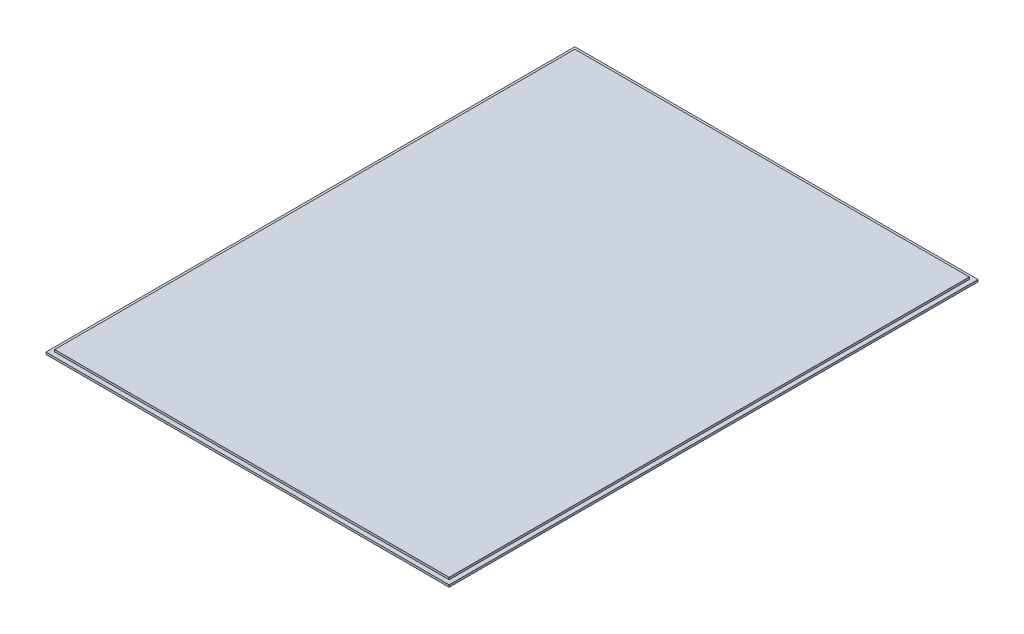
from build123d import *

# Parameters (mm, degrees)
SKETCH1_W           = 590.55
SKETCH1_H           = 774.7
BOSS_EXTRUDE1_DEPTH = 6.35
SKETCH3_OUTSIDE_W   = 787.378
SKETCH3_OUTSIDE_H   = 971.528
SKETCH3_OUTSIDE_W_2 = 577.85
SKETCH3_OUTSIDE_H_2 = 762
CUT_EXTRUDE1_DEPTH  = 3.175


with BuildPart() as part:
    # Sketch1 → Boss-Extrude1 (new body)
    with BuildSketch(Plane(origin=(0, 0, 0), x_dir=(1, 0, 0), z_dir=(0, 1, 0))):
        Rectangle(SKETCH1_W, SKETCH1_H)
    extrude(amount=BOSS_EXTRUDE1_DEPTH)

    # Sketch3 outside → Cut-Extrude1 (cut)
    with BuildSketch(Plane(origin=(0, 6.35, 0), x_dir=(1, 0, 0), z_dir=(0, 1, 0))):
        Rectangle(SKETCH3_OUTSIDE_W, SKETCH3_OUTSIDE_H)
        Rectangle(SKETCH3_OUTSIDE_W_2, SKETCH3_OUTSIDE_H_2, mode=Mode.SUBTRACT)
    extrude(amount=-CUT_EXTRUDE1_DEPTH, mode=Mode.SUBTRACT)


solid = part.part
